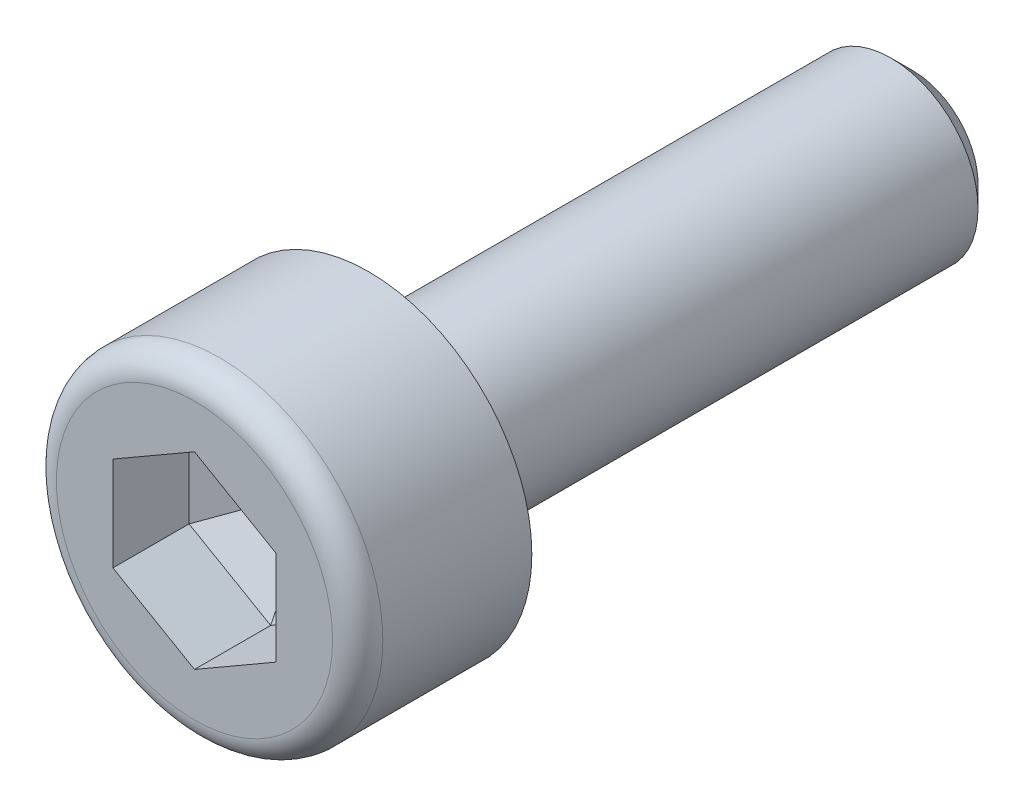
from build123d import *
from OCP.BRepFilletAPI import BRepFilletAPI_MakeChamfer

# Parameters (mm, degrees)
SKETCH_1_R          = 1.5
EXTRUDE_1_DEPTH     = 1.6
CUT_EXTRUDE_1_DEPTH = 1.132276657
SKETCH_3_R          = 0.8
EXTRUDE_2_DEPTH     = 5
CHAMFER_1_SIZE      = 0.2
FILLET_1_R          = 0.230769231
CHAMFER_2_SIZE      = 0.432276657
CHAMFER_2_SIZE2     = 0.748725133
FILLET_2_R          = 0.1


with BuildPart() as part:
    # Sketch 1 → Extrude 1 (new body)
    with BuildSketch(Plane.XY):
        Circle(SKETCH_1_R)
    extrude(amount=EXTRUDE_1_DEPTH)

    # Sketch 2 → Cut-Extrude 1 (cut)
    with BuildSketch(Plane.XY.offset(1.6)):
        Polygon((0.75, 0.433012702), (0, 0.866025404), (-0.75, 0.433012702), (-0.75, -0.433012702), (0, -0.866025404), (0.75, -0.433012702), align=None)
    extrude(amount=-CUT_EXTRUDE_1_DEPTH, mode=Mode.SUBTRACT)

    # Sketch 3 → Extrude 2 (add)
    with BuildSketch(Plane(origin=(0, 0, 0), x_dir=(-1, 0, 0), z_dir=(0, 0, -1))):
        with Locations(Location((0, 0, 0), (0, 0, 180))):
            Circle(SKETCH_3_R)
    extrude(amount=EXTRUDE_2_DEPTH)

    # Chamfer 1
    chamfer_1_edges = [part.edges().sort_by_distance(p)[0] for p in [
        (-0.8, 0, -5),
    ]]
    chamfer(chamfer_1_edges, length=CHAMFER_1_SIZE)

    # Fillet 1
    fillet_1_edges = [part.edges().sort_by_distance(p)[0] for p in [
        (-1.5, 0, 1.6),
    ]]
    fillet(fillet_1_edges, radius=FILLET_1_R)

    # Chamfer 2: one chamfer whose edges measure the first distance from different faces: ONE call of the kernel's chamfer builder (chamfer() names one face for all edges)
    chamfer_2_edges_1 = [part.edges().sort_by_distance(p)[0] for p in [
        (0.375, 0.649519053, 0.467723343),
    ]]
    chamfer_2_side_1 = [part.faces().sort_by_distance(p)[0] for p in [
        (0.375, 0.649519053, 1.033861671),
    ]]
    chamfer_2_edges_2 = [part.edges().sort_by_distance(p)[0] for p in [
        (0.75, 0, 0.467723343),
    ]]
    chamfer_2_side_2 = [part.faces().sort_by_distance(p)[0] for p in [
        (0.75, 0, 1.033861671),
    ]]
    chamfer_2_edges_3 = [part.edges().sort_by_distance(p)[0] for p in [
        (0.375, -0.649519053, 0.467723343),
    ]]
    chamfer_2_side_3 = [part.faces().sort_by_distance(p)[0] for p in [
        (0.375, -0.649519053, 1.033861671),
    ]]
    chamfer_2_edges_4 = [part.edges().sort_by_distance(p)[0] for p in [
        (-0.375, -0.649519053, 0.467723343),
    ]]
    chamfer_2_side_4 = [part.faces().sort_by_distance(p)[0] for p in [
        (-0.375, -0.649519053, 1.033861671),
    ]]
    chamfer_2_edges_5 = [part.edges().sort_by_distance(p)[0] for p in [
        (-0.75, 0, 0.467723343),
    ]]
    chamfer_2_side_5 = [part.faces().sort_by_distance(p)[0] for p in [
        (-0.75, 0, 1.033861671),
    ]]
    chamfer_2_edges_6 = [part.edges().sort_by_distance(p)[0] for p in [
        (-0.375, 0.649519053, 0.467723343),
    ]]
    chamfer_2_side_6 = [part.faces().sort_by_distance(p)[0] for p in [
        (-0.375, 0.649519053, 1.033861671),
    ]]
    chamfer_2 = BRepFilletAPI_MakeChamfer(part.part.solid().wrapped)
    for e in chamfer_2_edges_1:
        chamfer_2.Add(CHAMFER_2_SIZE, CHAMFER_2_SIZE2, e.wrapped, chamfer_2_side_1[0].wrapped)  # the first distance lies on this face
    for e in chamfer_2_edges_2:
        chamfer_2.Add(CHAMFER_2_SIZE, CHAMFER_2_SIZE2, e.wrapped, chamfer_2_side_2[0].wrapped)  # the first distance lies on this face
    for e in chamfer_2_edges_3:
        chamfer_2.Add(CHAMFER_2_SIZE, CHAMFER_2_SIZE2, e.wrapped, chamfer_2_side_3[0].wrapped)  # the first distance lies on this face
    for e in chamfer_2_edges_4:
        chamfer_2.Add(CHAMFER_2_SIZE, CHAMFER_2_SIZE2, e.wrapped, chamfer_2_side_4[0].wrapped)  # the first distance lies on this face
    for e in chamfer_2_edges_5:
        chamfer_2.Add(CHAMFER_2_SIZE, CHAMFER_2_SIZE2, e.wrapped, chamfer_2_side_5[0].wrapped)  # the first distance lies on this face
    for e in chamfer_2_edges_6:
        chamfer_2.Add(CHAMFER_2_SIZE, CHAMFER_2_SIZE2, e.wrapped, chamfer_2_side_6[0].wrapped)  # the first distance lies on this face
    add(Compound.cast(chamfer_2.Shape()), mode=Mode.REPLACE)

    # Fillet 2
    fillet_2_edges = [part.edges().sort_by_distance(p)[0] for p in [
        (-0.8, 0, 0),
    ]]
    fillet(fillet_2_edges, radius=FILLET_2_R)


solid = part.part
